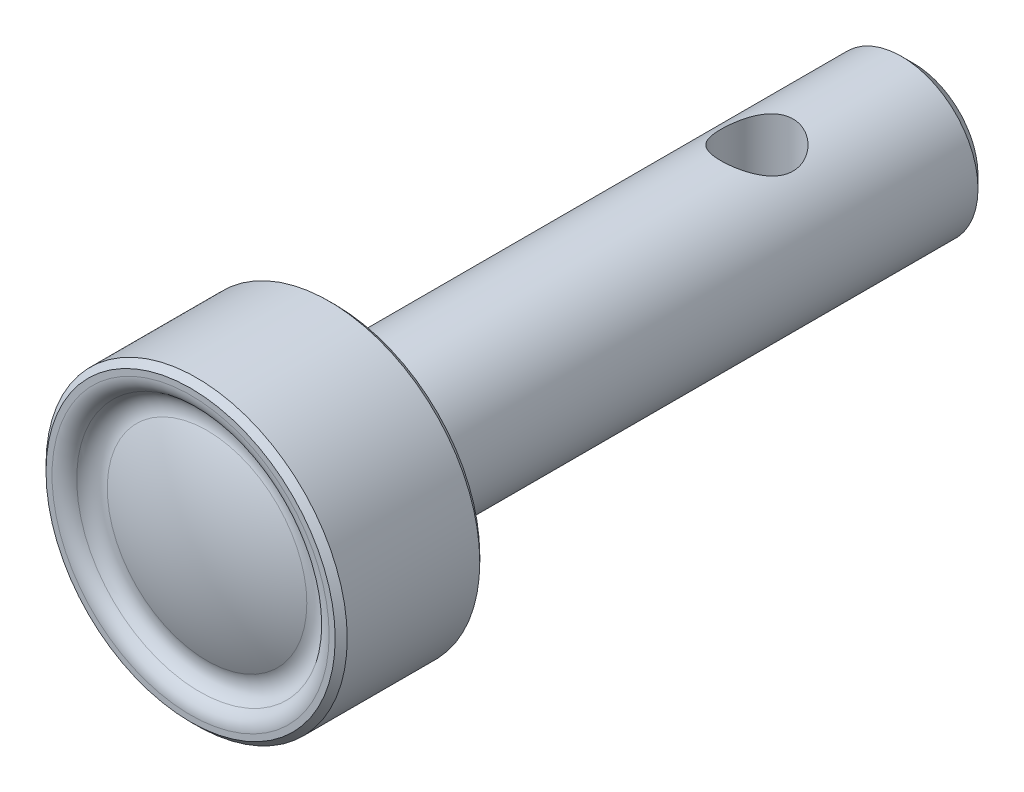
ISO-10303-21;
HEADER;
FILE_DESCRIPTION(('STEP AP214'),'2;1');
FILE_NAME('part.step','',(''),(''),'','','');
FILE_SCHEMA(('AUTOMOTIVE_DESIGN { 1 0 10303 214 1 1 1 1 }'));
ENDSEC;
DATA;
#1=APPLICATION_CONTEXT('core data for automotive mechanical design processes');
#2=APPLICATION_PROTOCOL_DEFINITION('international standard','automotive_design',2000,#1);
#3=PRODUCT_CONTEXT('',#1,'mechanical');
#4=PRODUCT('Part','Part','',(#3));
#5=PRODUCT_RELATED_PRODUCT_CATEGORY('part','',(#4));
#6=PRODUCT_DEFINITION_FORMATION('','',#4);
#7=PRODUCT_DEFINITION_CONTEXT('part definition',#1,'design');
#8=PRODUCT_DEFINITION('design','',#6,#7);
#9=PRODUCT_DEFINITION_SHAPE('','',#8);
#10=(LENGTH_UNIT() NAMED_UNIT(*) SI_UNIT(.MILLI.,.METRE.));
#11=(NAMED_UNIT(*) PLANE_ANGLE_UNIT() SI_UNIT($,.RADIAN.));
#12=(NAMED_UNIT(*) SI_UNIT($,.STERADIAN.) SOLID_ANGLE_UNIT());
#13=UNCERTAINTY_MEASURE_WITH_UNIT(LENGTH_MEASURE(1.E-05),#10,'distance_accuracy_value','');
#14=(GEOMETRIC_REPRESENTATION_CONTEXT(3) GLOBAL_UNCERTAINTY_ASSIGNED_CONTEXT((#13)) GLOBAL_UNIT_ASSIGNED_CONTEXT((#10,
#11,#12)) REPRESENTATION_CONTEXT('',''));
#15=CARTESIAN_POINT('',(0.,0.,0.));
#16=DIRECTION('',(0.,0.,1.));
#17=DIRECTION('',(1.,0.,0.));
#18=AXIS2_PLACEMENT_3D('',#15,#16,#17);
#19=CARTESIAN_POINT('',(0.,0.,0.));
#20=DIRECTION('',(0.,0.,1.));
#21=DIRECTION('',(1.,0.,0.));
#22=AXIS2_PLACEMENT_3D('',#19,#20,#21);
#23=PLANE('',#22);
#24=CARTESIAN_POINT('',(0.,0.,0.));
#25=DIRECTION('',(0.,0.,1.));
#26=DIRECTION('',(1.,0.,0.));
#27=AXIS2_PLACEMENT_3D('',#24,#25,#26);
#28=CIRCLE('',#27,5.35);
#29=CARTESIAN_POINT('',(5.35,0.,0.));
#30=VERTEX_POINT('',#29);
#31=EDGE_CURVE('E10',#30,#30,#28,.T.);
#32=ORIENTED_EDGE('',*,*,#31,.F.);
#33=EDGE_LOOP('',(#32));
#34=FACE_BOUND('',#33,.T.);
#35=ADVANCED_FACE('F29',(#34),#23,.F.);
#36=CARTESIAN_POINT('',(0.,0.,0.));
#37=DIRECTION('',(0.,0.,1.));
#38=DIRECTION('',(1.,0.,0.));
#39=AXIS2_PLACEMENT_3D('',#36,#37,#38);
#40=CONICAL_SURFACE('',#39,5.35,0.785398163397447);
#41=CARTESIAN_POINT('',(0.,0.,1.));
#42=DIRECTION('',(0.,0.,1.));
#43=DIRECTION('',(1.,0.,0.));
#44=AXIS2_PLACEMENT_3D('',#41,#42,#43);
#45=CIRCLE('',#44,6.35);
#46=CARTESIAN_POINT('',(6.35,0.,1.));
#47=VERTEX_POINT('',#46);
#48=EDGE_CURVE('E40',#47,#47,#45,.T.);
#49=ORIENTED_EDGE('',*,*,#48,.F.);
#50=EDGE_LOOP('',(#49));
#51=FACE_BOUND('',#50,.T.);
#52=ORIENTED_EDGE('',*,*,#31,.T.);
#53=EDGE_LOOP('',(#52));
#54=FACE_BOUND('',#53,.T.);
#55=ADVANCED_FACE('F94',(#51,#54),#40,.T.);
#56=CARTESIAN_POINT('',(0.,0.,60.4294672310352));
#57=DIRECTION('',(0.,0.,1.));
#58=DIRECTION('',(1.,0.,0.));
#59=AXIS2_PLACEMENT_3D('',#56,#57,#58);
#60=CYLINDRICAL_SURFACE('',#59,6.35);
#61=CARTESIAN_POINT('',(0.,-6.35,16.));
#62=CARTESIAN_POINT('',(0.158735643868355,-6.34999131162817,15.9999895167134));
#63=CARTESIAN_POINT('',(0.317696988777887,-6.34398210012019,15.9873262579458));
#64=CARTESIAN_POINT('',(0.630982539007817,-6.32053556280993,15.9371996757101));
#65=CARTESIAN_POINT('',(0.78529595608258,-6.30307351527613,15.8996827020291));
#66=CARTESIAN_POINT('',(1.0842690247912,-6.25856360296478,15.8016090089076));
#67=CARTESIAN_POINT('',(1.22896239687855,-6.23155157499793,15.7411383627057));
#68=CARTESIAN_POINT('',(1.50596538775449,-6.17047124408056,15.5992895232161));
#69=CARTESIAN_POINT('',(1.63827688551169,-6.1364040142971,15.5179145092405));
#70=CARTESIAN_POINT('',(1.89506470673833,-6.06218401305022,15.3313710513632));
#71=CARTESIAN_POINT('',(2.0186935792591,-6.02179791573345,15.2251294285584));
#72=CARTESIAN_POINT('',(2.24713450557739,-5.94033863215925,14.9941964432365));
#73=CARTESIAN_POINT('',(2.35193384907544,-5.8992650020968,14.8694927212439));
#74=CARTESIAN_POINT('',(2.54682621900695,-5.81791039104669,14.5949351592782));
#75=CARTESIAN_POINT('',(2.63545600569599,-5.77786853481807,14.4439538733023));
#76=CARTESIAN_POINT('',(2.74809115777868,-5.72470256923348,14.2065236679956));
#77=CARTESIAN_POINT('',(2.78225974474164,-5.70812542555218,14.1255234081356));
#78=CARTESIAN_POINT('',(2.84348823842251,-5.67787297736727,13.9603719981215));
#79=CARTESIAN_POINT('',(2.87055214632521,-5.66419604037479,13.8762226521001));
#80=CARTESIAN_POINT('',(2.9159220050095,-5.6409673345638,13.7102013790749));
#81=CARTESIAN_POINT('',(2.93463412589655,-5.63122717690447,13.6284665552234));
#82=CARTESIAN_POINT('',(2.96517735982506,-5.6152044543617,13.4634237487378));
#83=CARTESIAN_POINT('',(2.9770119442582,-5.60892014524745,13.3801165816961));
#84=CARTESIAN_POINT('',(2.99363646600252,-5.60006542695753,13.2126376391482));
#85=CARTESIAN_POINT('',(2.99842966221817,-5.5974932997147,13.1284662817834));
#86=CARTESIAN_POINT('',(3.00091788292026,-5.59615798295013,12.9600155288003));
#87=CARTESIAN_POINT('',(2.99861346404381,-5.59739449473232,12.8757361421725));
#88=CARTESIAN_POINT('',(2.98228707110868,-5.60612787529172,12.6413526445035));
#89=CARTESIAN_POINT('',(2.96044454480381,-5.61779971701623,12.4918613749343));
#90=CARTESIAN_POINT('',(2.89501216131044,-5.6517888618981,12.19908293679));
#91=CARTESIAN_POINT('',(2.85141651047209,-5.67410900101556,12.0557974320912));
#92=CARTESIAN_POINT('',(2.74288007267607,-5.72737541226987,11.7753647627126));
#93=CARTESIAN_POINT('',(2.67746822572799,-5.758509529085,11.6384366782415));
#94=CARTESIAN_POINT('',(2.52750090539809,-5.82588930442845,11.3768863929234));
#95=CARTESIAN_POINT('',(2.44293700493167,-5.86213721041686,11.2522696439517));
#96=CARTESIAN_POINT('',(2.24603652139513,-5.94055944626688,11.0042286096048));
#97=CARTESIAN_POINT('',(2.13165370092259,-5.98294371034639,10.8824894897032));
#98=CARTESIAN_POINT('',(1.88382332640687,-6.06553935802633,10.6592659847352));
#99=CARTESIAN_POINT('',(1.75036848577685,-6.10574990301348,10.5577893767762));
#100=CARTESIAN_POINT('',(1.46180089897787,-6.1813162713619,10.3744689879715));
#101=CARTESIAN_POINT('',(1.30606552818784,-6.21643476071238,10.2934997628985));
#102=CARTESIAN_POINT('',(0.981099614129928,-6.27591792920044,10.1595302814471));
#103=CARTESIAN_POINT('',(0.811878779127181,-6.30029026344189,10.1065101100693));
#104=CARTESIAN_POINT('',(0.478650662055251,-6.33397698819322,10.0339065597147));
#105=CARTESIAN_POINT('',(0.315236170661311,-6.34430139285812,10.0120739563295));
#106=CARTESIAN_POINT('',(-0.0132401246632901,-6.35210748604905,9.99553099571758));
#107=CARTESIAN_POINT('',(-0.178301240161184,-6.34959433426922,10.0008097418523));
#108=CARTESIAN_POINT('',(-0.493581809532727,-6.33262500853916,10.036917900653));
#109=CARTESIAN_POINT('',(-0.644051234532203,-6.31898607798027,10.0659993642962));
#110=CARTESIAN_POINT('',(-0.937719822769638,-6.28212499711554,10.1462549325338));
#111=CARTESIAN_POINT('',(-1.08091814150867,-6.25890173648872,10.1974315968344));
#112=CARTESIAN_POINT('',(-1.36096532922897,-6.20413258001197,10.3219455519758));
#113=CARTESIAN_POINT('',(-1.49748886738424,-6.17235515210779,10.3959091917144));
#114=CARTESIAN_POINT('',(-1.75666682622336,-6.103656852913,10.5632108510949));
#115=CARTESIAN_POINT('',(-1.87931512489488,-6.06673372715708,10.6565573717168));
#116=CARTESIAN_POINT('',(-2.11888943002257,-5.98749695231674,10.8696803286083));
#117=CARTESIAN_POINT('',(-2.23431643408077,-5.94499681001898,10.9910760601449));
#118=CARTESIAN_POINT('',(-2.44375164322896,-5.86202140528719,11.2518400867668));
#119=CARTESIAN_POINT('',(-2.53774887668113,-5.82154718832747,11.3912175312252));
#120=CARTESIAN_POINT('',(-2.70463547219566,-5.74596844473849,11.69031721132));
#121=CARTESIAN_POINT('',(-2.77667149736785,-5.71110126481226,11.8505805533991));
#122=CARTESIAN_POINT('',(-2.89199593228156,-5.65359008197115,12.1831514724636));
#123=CARTESIAN_POINT('',(-2.93531709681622,-5.63093215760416,12.3554450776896));
#124=CARTESIAN_POINT('',(-2.98833110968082,-5.60296296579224,12.6902731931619));
#125=CARTESIAN_POINT('',(-3.0007349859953,-5.59625585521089,12.8522609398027));
#126=CARTESIAN_POINT('',(-2.99919821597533,-5.5970815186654,13.1760513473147));
#127=CARTESIAN_POINT('',(-2.98526553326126,-5.60460998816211,13.3378540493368));
#128=CARTESIAN_POINT('',(-2.93391097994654,-5.63164218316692,13.6437237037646));
#129=CARTESIAN_POINT('',(-2.8983673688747,-5.65018584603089,13.7882005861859));
#130=CARTESIAN_POINT('',(-2.80694513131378,-5.69615317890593,14.0690579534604));
#131=CARTESIAN_POINT('',(-2.75106038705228,-5.72357952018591,14.2054359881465));
#132=CARTESIAN_POINT('',(-2.61632375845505,-5.78646860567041,14.4762209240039));
#133=CARTESIAN_POINT('',(-2.53618984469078,-5.8223450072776,14.6098912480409));
#134=CARTESIAN_POINT('',(-2.35675969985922,-5.89725587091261,14.8627222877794));
#135=CARTESIAN_POINT('',(-2.25745430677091,-5.93629183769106,14.9818760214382));
#136=CARTESIAN_POINT('',(-2.03038590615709,-6.01797799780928,15.2151093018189));
#137=CARTESIAN_POINT('',(-1.90073846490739,-6.06058247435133,15.3273764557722));
#138=CARTESIAN_POINT('',(-1.62298549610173,-6.14078504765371,15.528894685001));
#139=CARTESIAN_POINT('',(-1.47487109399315,-6.17838071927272,15.6181346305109));
#140=CARTESIAN_POINT('',(-1.24202481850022,-6.22785646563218,15.7321870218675));
#141=CARTESIAN_POINT('',(-1.16272476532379,-6.24318215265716,15.7668755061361));
#142=CARTESIAN_POINT('',(-1.00102034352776,-6.27113792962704,15.8293917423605));
#143=CARTESIAN_POINT('',(-0.918617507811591,-6.283769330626,15.8572228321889));
#144=CARTESIAN_POINT('',(-0.751519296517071,-6.30593452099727,15.9056447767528));
#145=CARTESIAN_POINT('',(-0.666829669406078,-6.31547541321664,15.926252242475));
#146=CARTESIAN_POINT('',(-0.495718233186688,-6.33120329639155,15.9600439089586));
#147=CARTESIAN_POINT('',(-0.409297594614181,-6.33739247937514,15.9732329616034));
#148=CARTESIAN_POINT('',(-0.268909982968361,-6.34452974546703,15.9884080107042));
#149=CARTESIAN_POINT('',(-0.215242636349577,-6.34657804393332,15.9927517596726));
#150=CARTESIAN_POINT('',(-0.107725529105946,-6.34931466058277,15.9985495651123));
#151=CARTESIAN_POINT('',(-0.0538757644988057,-6.35000294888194,16.0000035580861));
#152=CARTESIAN_POINT('',(0.,-6.35,16.));
#153=B_SPLINE_CURVE_WITH_KNOTS('',3,(#61,#62,#63,#64,#65,#66,#67,#68,#69,#70,#71,#72,#73,#74,
#75,#76,#77,#78,#79,#80,#81,#82,#83,#84,#85,#86,#87,#88,#89,#90,#91,#92,#93,#94,#95,#96,#97,#98,
#99,#100,#101,#102,#103,#104,#105,#106,#107,#108,#109,#110,#111,#112,#113,#114,#115,#116,#117,
#118,#119,#120,#121,#122,#123,#124,#125,#126,#127,#128,#129,#130,#131,#132,#133,#134,#135,#136,
#137,#138,#139,#140,#141,#142,#143,#144,#145,#146,#147,#148,#149,#150,#151,#152),.UNSPECIFIED.,
.T.,.F.,(4,2,2,2,2,2,2,2,2,2,2,2,2,2,2,2,2,2,2,2,2,2,2,2,2,2,2,2,2,2,2,2,2,2,2,2,2,2,2,2,2,2,2,
2,2,4),(0.,0.475997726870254,0.953026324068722,1.42828352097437,1.90346847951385,2.405132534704,
2.90713396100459,3.44289983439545,3.71097177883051,3.97889242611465,4.23178157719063,
4.48454297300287,4.73718734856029,4.98981191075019,5.44206841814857,5.89444544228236,
6.35730164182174,6.82036189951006,7.33510031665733,7.85003592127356,8.38419883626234,
8.91798061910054,9.41089442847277,9.9036101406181,10.3630820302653,10.8226071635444,
11.2961009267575,11.7698027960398,12.2859764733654,12.8024138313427,13.336915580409,
13.8708065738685,14.3559144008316,14.8408755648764,15.2887410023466,15.7367412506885,
16.2145869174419,16.6926615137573,17.2203903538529,17.7483737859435,18.0117778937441,
18.275053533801,18.5377197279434,18.8002139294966,18.9617666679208,19.1233229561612),.UNSPECIFIED.);
#154=CARTESIAN_POINT('',(0.,-6.35,16.));
#155=VERTEX_POINT('',#154);
#156=EDGE_CURVE('E32',#155,#155,#153,.T.);
#157=ORIENTED_EDGE('',*,*,#156,.T.);
#158=EDGE_LOOP('',(#157));
#159=FACE_BOUND('',#158,.T.);
#160=CARTESIAN_POINT('',(0.,6.35,16.));
#161=CARTESIAN_POINT('',(-0.158735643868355,6.34999131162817,15.9999895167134));
#162=CARTESIAN_POINT('',(-0.317696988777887,6.34398210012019,15.9873262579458));
#163=CARTESIAN_POINT('',(-0.630982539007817,6.32053556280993,15.9371996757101));
#164=CARTESIAN_POINT('',(-0.78529595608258,6.30307351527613,15.8996827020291));
#165=CARTESIAN_POINT('',(-1.0842690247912,6.25856360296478,15.8016090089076));
#166=CARTESIAN_POINT('',(-1.22896239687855,6.23155157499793,15.7411383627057));
#167=CARTESIAN_POINT('',(-1.50596538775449,6.17047124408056,15.5992895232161));
#168=CARTESIAN_POINT('',(-1.63827688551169,6.1364040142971,15.5179145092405));
#169=CARTESIAN_POINT('',(-1.89506470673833,6.06218401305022,15.3313710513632));
#170=CARTESIAN_POINT('',(-2.0186935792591,6.02179791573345,15.2251294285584));
#171=CARTESIAN_POINT('',(-2.24713450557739,5.94033863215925,14.9941964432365));
#172=CARTESIAN_POINT('',(-2.35193384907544,5.8992650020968,14.8694927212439));
#173=CARTESIAN_POINT('',(-2.54682621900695,5.81791039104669,14.5949351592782));
#174=CARTESIAN_POINT('',(-2.63545600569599,5.77786853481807,14.4439538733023));
#175=CARTESIAN_POINT('',(-2.74809115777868,5.72470256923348,14.2065236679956));
#176=CARTESIAN_POINT('',(-2.78225974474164,5.70812542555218,14.1255234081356));
#177=CARTESIAN_POINT('',(-2.84348823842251,5.67787297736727,13.9603719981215));
#178=CARTESIAN_POINT('',(-2.87055214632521,5.66419604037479,13.8762226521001));
#179=CARTESIAN_POINT('',(-2.9159220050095,5.6409673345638,13.7102013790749));
#180=CARTESIAN_POINT('',(-2.93463412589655,5.63122717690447,13.6284665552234));
#181=CARTESIAN_POINT('',(-2.96517735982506,5.6152044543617,13.4634237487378));
#182=CARTESIAN_POINT('',(-2.9770119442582,5.60892014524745,13.3801165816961));
#183=CARTESIAN_POINT('',(-2.99363646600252,5.60006542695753,13.2126376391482));
#184=CARTESIAN_POINT('',(-2.99842966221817,5.5974932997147,13.1284662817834));
#185=CARTESIAN_POINT('',(-3.00091788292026,5.59615798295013,12.9600155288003));
#186=CARTESIAN_POINT('',(-2.99861346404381,5.59739449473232,12.8757361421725));
#187=CARTESIAN_POINT('',(-2.98228707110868,5.60612787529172,12.6413526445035));
#188=CARTESIAN_POINT('',(-2.96044454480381,5.61779971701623,12.4918613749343));
#189=CARTESIAN_POINT('',(-2.89501216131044,5.6517888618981,12.19908293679));
#190=CARTESIAN_POINT('',(-2.85141651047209,5.67410900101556,12.0557974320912));
#191=CARTESIAN_POINT('',(-2.74288007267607,5.72737541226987,11.7753647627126));
#192=CARTESIAN_POINT('',(-2.67746822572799,5.758509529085,11.6384366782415));
#193=CARTESIAN_POINT('',(-2.52750090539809,5.82588930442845,11.3768863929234));
#194=CARTESIAN_POINT('',(-2.44293700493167,5.86213721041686,11.2522696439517));
#195=CARTESIAN_POINT('',(-2.24603652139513,5.94055944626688,11.0042286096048));
#196=CARTESIAN_POINT('',(-2.13165370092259,5.98294371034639,10.8824894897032));
#197=CARTESIAN_POINT('',(-1.88382332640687,6.06553935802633,10.6592659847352));
#198=CARTESIAN_POINT('',(-1.75036848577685,6.10574990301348,10.5577893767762));
#199=CARTESIAN_POINT('',(-1.46180089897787,6.1813162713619,10.3744689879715));
#200=CARTESIAN_POINT('',(-1.30606552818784,6.21643476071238,10.2934997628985));
#201=CARTESIAN_POINT('',(-0.981099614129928,6.27591792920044,10.1595302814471));
#202=CARTESIAN_POINT('',(-0.811878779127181,6.30029026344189,10.1065101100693));
#203=CARTESIAN_POINT('',(-0.478650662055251,6.33397698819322,10.0339065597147));
#204=CARTESIAN_POINT('',(-0.315236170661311,6.34430139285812,10.0120739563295));
#205=CARTESIAN_POINT('',(0.0132401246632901,6.35210748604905,9.99553099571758));
#206=CARTESIAN_POINT('',(0.178301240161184,6.34959433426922,10.0008097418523));
#207=CARTESIAN_POINT('',(0.493581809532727,6.33262500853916,10.036917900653));
#208=CARTESIAN_POINT('',(0.644051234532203,6.31898607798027,10.0659993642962));
#209=CARTESIAN_POINT('',(0.937719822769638,6.28212499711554,10.1462549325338));
#210=CARTESIAN_POINT('',(1.08091814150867,6.25890173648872,10.1974315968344));
#211=CARTESIAN_POINT('',(1.36096532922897,6.20413258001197,10.3219455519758));
#212=CARTESIAN_POINT('',(1.49748886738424,6.17235515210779,10.3959091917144));
#213=CARTESIAN_POINT('',(1.75666682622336,6.103656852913,10.5632108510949));
#214=CARTESIAN_POINT('',(1.87931512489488,6.06673372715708,10.6565573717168));
#215=CARTESIAN_POINT('',(2.11888943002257,5.98749695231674,10.8696803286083));
#216=CARTESIAN_POINT('',(2.23431643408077,5.94499681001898,10.9910760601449));
#217=CARTESIAN_POINT('',(2.44375164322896,5.86202140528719,11.2518400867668));
#218=CARTESIAN_POINT('',(2.53774887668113,5.82154718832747,11.3912175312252));
#219=CARTESIAN_POINT('',(2.70463547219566,5.74596844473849,11.69031721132));
#220=CARTESIAN_POINT('',(2.77667149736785,5.71110126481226,11.8505805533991));
#221=CARTESIAN_POINT('',(2.89199593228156,5.65359008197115,12.1831514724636));
#222=CARTESIAN_POINT('',(2.93531709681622,5.63093215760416,12.3554450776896));
#223=CARTESIAN_POINT('',(2.98833110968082,5.60296296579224,12.6902731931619));
#224=CARTESIAN_POINT('',(3.0007349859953,5.59625585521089,12.8522609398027));
#225=CARTESIAN_POINT('',(2.99919821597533,5.5970815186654,13.1760513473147));
#226=CARTESIAN_POINT('',(2.98526553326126,5.60460998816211,13.3378540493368));
#227=CARTESIAN_POINT('',(2.93391097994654,5.63164218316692,13.6437237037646));
#228=CARTESIAN_POINT('',(2.8983673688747,5.65018584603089,13.7882005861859));
#229=CARTESIAN_POINT('',(2.80694513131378,5.69615317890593,14.0690579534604));
#230=CARTESIAN_POINT('',(2.75106038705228,5.72357952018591,14.2054359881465));
#231=CARTESIAN_POINT('',(2.61632375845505,5.78646860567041,14.4762209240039));
#232=CARTESIAN_POINT('',(2.53618984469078,5.8223450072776,14.6098912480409));
#233=CARTESIAN_POINT('',(2.35675969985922,5.89725587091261,14.8627222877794));
#234=CARTESIAN_POINT('',(2.25745430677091,5.93629183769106,14.9818760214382));
#235=CARTESIAN_POINT('',(2.03038590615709,6.01797799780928,15.2151093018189));
#236=CARTESIAN_POINT('',(1.90073846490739,6.06058247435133,15.3273764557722));
#237=CARTESIAN_POINT('',(1.62298549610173,6.14078504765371,15.528894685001));
#238=CARTESIAN_POINT('',(1.47487109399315,6.17838071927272,15.6181346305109));
#239=CARTESIAN_POINT('',(1.24202481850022,6.22785646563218,15.7321870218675));
#240=CARTESIAN_POINT('',(1.16272476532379,6.24318215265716,15.7668755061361));
#241=CARTESIAN_POINT('',(1.00102034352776,6.27113792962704,15.8293917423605));
#242=CARTESIAN_POINT('',(0.918617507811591,6.283769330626,15.8572228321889));
#243=CARTESIAN_POINT('',(0.751519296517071,6.30593452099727,15.9056447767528));
#244=CARTESIAN_POINT('',(0.666829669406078,6.31547541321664,15.926252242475));
#245=CARTESIAN_POINT('',(0.495718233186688,6.33120329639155,15.9600439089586));
#246=CARTESIAN_POINT('',(0.409297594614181,6.33739247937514,15.9732329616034));
#247=CARTESIAN_POINT('',(0.268909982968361,6.34452974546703,15.9884080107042));
#248=CARTESIAN_POINT('',(0.215242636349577,6.34657804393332,15.9927517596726));
#249=CARTESIAN_POINT('',(0.107725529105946,6.34931466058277,15.9985495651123));
#250=CARTESIAN_POINT('',(0.0538757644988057,6.35000294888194,16.0000035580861));
#251=CARTESIAN_POINT('',(0.,6.35,16.));
#252=B_SPLINE_CURVE_WITH_KNOTS('',3,(#160,#161,#162,#163,#164,#165,#166,#167,#168,#169,#170,
#171,#172,#173,#174,#175,#176,#177,#178,#179,#180,#181,#182,#183,#184,#185,#186,#187,#188,#189,
#190,#191,#192,#193,#194,#195,#196,#197,#198,#199,#200,#201,#202,#203,#204,#205,#206,#207,#208,
#209,#210,#211,#212,#213,#214,#215,#216,#217,#218,#219,#220,#221,#222,#223,#224,#225,#226,#227,
#228,#229,#230,#231,#232,#233,#234,#235,#236,#237,#238,#239,#240,#241,#242,#243,#244,#245,#246,
#247,#248,#249,#250,#251),.UNSPECIFIED.,.T.,.F.,(4,2,2,2,2,2,2,2,2,2,2,2,2,2,2,2,2,2,2,2,2,2,2,
2,2,2,2,2,2,2,2,2,2,2,2,2,2,2,2,2,2,2,2,2,2,4),(0.,0.475997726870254,0.953026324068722,
1.42828352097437,1.90346847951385,2.405132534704,2.90713396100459,3.44289983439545,
3.71097177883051,3.97889242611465,4.23178157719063,4.48454297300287,4.73718734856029,
4.98981191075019,5.44206841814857,5.89444544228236,6.35730164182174,6.82036189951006,
7.33510031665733,7.85003592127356,8.38419883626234,8.91798061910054,9.41089442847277,
9.9036101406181,10.3630820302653,10.8226071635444,11.2961009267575,11.7698027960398,
12.2859764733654,12.8024138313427,13.336915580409,13.8708065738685,14.3559144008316,
14.8408755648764,15.2887410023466,15.7367412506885,16.2145869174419,16.6926615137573,
17.2203903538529,17.7483737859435,18.0117778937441,18.275053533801,18.5377197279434,
18.8002139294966,18.9617666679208,19.1233229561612),.UNSPECIFIED.);
#253=CARTESIAN_POINT('',(0.,6.35,16.));
#254=VERTEX_POINT('',#253);
#255=EDGE_CURVE('E48',#254,#254,#252,.T.);
#256=ORIENTED_EDGE('',*,*,#255,.T.);
#257=EDGE_LOOP('',(#256));
#258=FACE_BOUND('',#257,.T.);
#259=CARTESIAN_POINT('',(0.,0.,48.));
#260=DIRECTION('',(0.,0.,1.));
#261=DIRECTION('',(1.,0.,0.));
#262=AXIS2_PLACEMENT_3D('',#259,#260,#261);
#263=CIRCLE('',#262,6.34999999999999);
#264=CARTESIAN_POINT('',(6.34999999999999,0.,48.));
#265=VERTEX_POINT('',#264);
#266=EDGE_CURVE('E45',#265,#265,#263,.T.);
#267=ORIENTED_EDGE('',*,*,#266,.F.);
#268=EDGE_LOOP('',(#267));
#269=FACE_BOUND('',#268,.T.);
#270=ORIENTED_EDGE('',*,*,#48,.T.);
#271=EDGE_LOOP('',(#270));
#272=FACE_BOUND('',#271,.T.);
#273=ADVANCED_FACE('F52',(#159,#258,#269,#272),#60,.T.);
#274=CARTESIAN_POINT('',(0.,6.34999999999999,48.));
#275=DIRECTION('',(0.,0.,1.));
#276=DIRECTION('',(1.,0.,0.));
#277=AXIS2_PLACEMENT_3D('',#274,#275,#276);
#278=PLANE('',#277);
#279=CARTESIAN_POINT('',(0.,0.,48.));
#280=DIRECTION('',(0.,0.,1.));
#281=DIRECTION('',(1.,0.,0.));
#282=AXIS2_PLACEMENT_3D('',#279,#280,#281);
#283=CIRCLE('',#282,12.);
#284=CARTESIAN_POINT('',(12.,0.,48.));
#285=VERTEX_POINT('',#284);
#286=EDGE_CURVE('E175',#285,#285,#283,.T.);
#287=ORIENTED_EDGE('',*,*,#286,.F.);
#288=EDGE_LOOP('',(#287));
#289=FACE_BOUND('',#288,.T.);
#290=ORIENTED_EDGE('',*,*,#266,.T.);
#291=EDGE_LOOP('',(#290));
#292=FACE_BOUND('',#291,.T.);
#293=ADVANCED_FACE('F87',(#289,#292),#278,.F.);
#294=CARTESIAN_POINT('',(0.,0.,48.));
#295=DIRECTION('',(0.,0.,1.));
#296=DIRECTION('',(1.,0.,0.));
#297=AXIS2_PLACEMENT_3D('',#294,#295,#296);
#298=CONICAL_SURFACE('',#297,12.,0.78539816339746);
#299=CARTESIAN_POINT('',(0.,0.,48.5));
#300=DIRECTION('',(0.,0.,1.));
#301=DIRECTION('',(1.,0.,0.));
#302=AXIS2_PLACEMENT_3D('',#299,#300,#301);
#303=CIRCLE('',#302,12.5);
#304=CARTESIAN_POINT('',(12.5,0.,48.5));
#305=VERTEX_POINT('',#304);
#306=EDGE_CURVE('E179',#305,#305,#303,.T.);
#307=ORIENTED_EDGE('',*,*,#306,.F.);
#308=EDGE_LOOP('',(#307));
#309=FACE_BOUND('',#308,.T.);
#310=ORIENTED_EDGE('',*,*,#286,.T.);
#311=EDGE_LOOP('',(#310));
#312=FACE_BOUND('',#311,.T.);
#313=ADVANCED_FACE('F84',(#309,#312),#298,.T.);
#314=CARTESIAN_POINT('',(0.,0.,60.4294672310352));
#315=DIRECTION('',(0.,0.,1.));
#316=DIRECTION('',(1.,0.,0.));
#317=AXIS2_PLACEMENT_3D('',#314,#315,#316);
#318=CYLINDRICAL_SURFACE('',#317,12.5);
#319=CARTESIAN_POINT('',(0.,0.,59.5));
#320=DIRECTION('',(0.,0.,1.));
#321=DIRECTION('',(1.,0.,0.));
#322=AXIS2_PLACEMENT_3D('',#319,#320,#321);
#323=CIRCLE('',#322,12.5);
#324=CARTESIAN_POINT('',(12.5,0.,59.5));
#325=VERTEX_POINT('',#324);
#326=EDGE_CURVE('E184',#325,#325,#323,.T.);
#327=ORIENTED_EDGE('',*,*,#326,.F.);
#328=EDGE_LOOP('',(#327));
#329=FACE_BOUND('',#328,.T.);
#330=ORIENTED_EDGE('',*,*,#306,.T.);
#331=EDGE_LOOP('',(#330));
#332=FACE_BOUND('',#331,.T.);
#333=ADVANCED_FACE('F80',(#329,#332),#318,.T.);
#334=CARTESIAN_POINT('',(0.,0.,59.5));
#335=DIRECTION('',(0.,0.,-1.));
#336=DIRECTION('',(-1.,0.,0.));
#337=AXIS2_PLACEMENT_3D('',#334,#335,#336);
#338=CONICAL_SURFACE('',#337,12.5,0.78539816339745);
#339=CARTESIAN_POINT('',(0.,0.,60.));
#340=DIRECTION('',(0.,0.,1.));
#341=DIRECTION('',(1.,0.,0.));
#342=AXIS2_PLACEMENT_3D('',#339,#340,#341);
#343=CIRCLE('',#342,12.);
#344=CARTESIAN_POINT('',(12.,0.,60.));
#345=VERTEX_POINT('',#344);
#346=EDGE_CURVE('E187',#345,#345,#343,.T.);
#347=ORIENTED_EDGE('',*,*,#346,.F.);
#348=EDGE_LOOP('',(#347));
#349=FACE_BOUND('',#348,.T.);
#350=ORIENTED_EDGE('',*,*,#326,.T.);
#351=EDGE_LOOP('',(#350));
#352=FACE_BOUND('',#351,.T.);
#353=ADVANCED_FACE('F76',(#349,#352),#338,.T.);
#354=CARTESIAN_POINT('',(0.,12.,60.));
#355=DIRECTION('',(0.,0.,-1.));
#356=DIRECTION('',(-1.,0.,0.));
#357=AXIS2_PLACEMENT_3D('',#354,#355,#356);
#358=PLANE('',#357);
#359=CARTESIAN_POINT('',(0.,0.,60.));
#360=DIRECTION('',(0.,0.,1.));
#361=DIRECTION('',(1.,0.,0.));
#362=AXIS2_PLACEMENT_3D('',#359,#360,#361);
#363=CIRCLE('',#362,11.5);
#364=CARTESIAN_POINT('',(11.5,0.,60.));
#365=VERTEX_POINT('',#364);
#366=EDGE_CURVE('E190',#365,#365,#363,.T.);
#367=ORIENTED_EDGE('',*,*,#366,.F.);
#368=EDGE_LOOP('',(#367));
#369=FACE_BOUND('',#368,.T.);
#370=ORIENTED_EDGE('',*,*,#346,.T.);
#371=EDGE_LOOP('',(#370));
#372=FACE_BOUND('',#371,.T.);
#373=ADVANCED_FACE('F72',(#369,#372),#358,.F.);
#374=CARTESIAN_POINT('',(0.,0.,58.5));
#375=DIRECTION('',(0.,0.,1.));
#376=DIRECTION('',(1.,0.,0.));
#377=AXIS2_PLACEMENT_3D('',#374,#375,#376);
#378=TOROIDAL_SURFACE('',#377,11.5,1.5);
#379=CARTESIAN_POINT('',(0.,0.,59.25));
#380=DIRECTION('',(0.,0.,1.));
#381=DIRECTION('',(1.,0.,0.));
#382=AXIS2_PLACEMENT_3D('',#379,#380,#381);
#383=CIRCLE('',#382,10.2009618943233);
#384=CARTESIAN_POINT('',(10.2009618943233,0.,59.25));
#385=VERTEX_POINT('',#384);
#386=EDGE_CURVE('E193',#385,#385,#383,.T.);
#387=ORIENTED_EDGE('',*,*,#386,.F.);
#388=EDGE_LOOP('',(#387));
#389=FACE_BOUND('',#388,.T.);
#390=ORIENTED_EDGE('',*,*,#366,.T.);
#391=EDGE_LOOP('',(#390));
#392=FACE_BOUND('',#391,.T.);
#393=ADVANCED_FACE('F68',(#389,#392),#378,.T.);
#394=CARTESIAN_POINT('',(0.,0.,60.));
#395=DIRECTION('',(0.,0.,1.));
#396=DIRECTION('',(1.,0.,0.));
#397=AXIS2_PLACEMENT_3D('',#394,#395,#396);
#398=TOROIDAL_SURFACE('',#397,8.90192378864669,1.50000000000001);
#399=CARTESIAN_POINT('',(0.,0.,58.6346139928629));
#400=DIRECTION('',(0.,0.,1.));
#401=DIRECTION('',(1.,0.,0.));
#402=AXIS2_PLACEMENT_3D('',#399,#400,#401);
#403=CIRCLE('',#402,8.28085933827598);
#404=CARTESIAN_POINT('',(8.28085933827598,0.,58.6346139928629));
#405=VERTEX_POINT('',#404);
#406=EDGE_CURVE('E196',#405,#405,#403,.T.);
#407=ORIENTED_EDGE('',*,*,#406,.F.);
#408=EDGE_LOOP('',(#407));
#409=FACE_BOUND('',#408,.T.);
#410=ORIENTED_EDGE('',*,*,#386,.T.);
#411=EDGE_LOOP('',(#410));
#412=FACE_BOUND('',#411,.T.);
#413=ADVANCED_FACE('F64',(#409,#412),#398,.F.);
#414=CARTESIAN_POINT('',(0.,0.,40.4294672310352));
#415=DIRECTION('',(0.,0.,1.));
#416=DIRECTION('',(0.,1.,0.));
#417=AXIS2_PLACEMENT_3D('',#414,#415,#416);
#418=SPHERICAL_SURFACE('',#417,20.);
#419=ORIENTED_EDGE('',*,*,#406,.T.);
#420=EDGE_LOOP('',(#419));
#421=FACE_BOUND('',#420,.T.);
#422=ADVANCED_FACE('F59',(#421),#418,.T.);
#423=CARTESIAN_POINT('',(0.,-10.,13.));
#424=DIRECTION('',(0.,1.,0.));
#425=DIRECTION('',(0.,0.,1.));
#426=AXIS2_PLACEMENT_3D('',#423,#424,#425);
#427=CYLINDRICAL_SURFACE('',#426,3.);
#428=ORIENTED_EDGE('',*,*,#255,.F.);
#429=EDGE_LOOP('',(#428));
#430=FACE_BOUND('',#429,.T.);
#431=ORIENTED_EDGE('',*,*,#156,.F.);
#432=EDGE_LOOP('',(#431));
#433=FACE_BOUND('',#432,.T.);
#434=ADVANCED_FACE('F55',(#430,#433),#427,.F.);
#435=CLOSED_SHELL('',(#35,#55,#273,#293,#313,#333,#353,#373,#393,#413,#422,#434));
#436=MANIFOLD_SOLID_BREP('B2',#435);
#437=ADVANCED_BREP_SHAPE_REPRESENTATION('',(#18,#436),#14);
#438=SHAPE_DEFINITION_REPRESENTATION(#9,#437);
ENDSEC;
END-ISO-10303-21;
